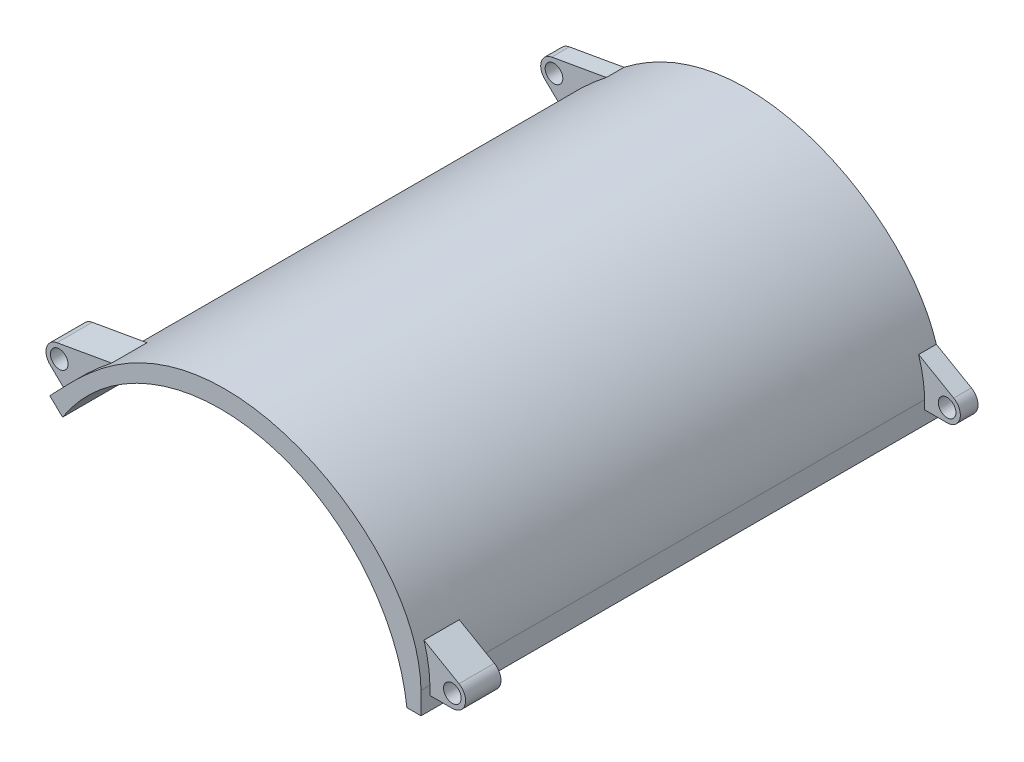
from build123d import *

# Parameters (mm, degrees)
BOSS_EXTRUDE1_DEPTH  = 295
BOSS_EXTRUDE13_START = -295
SKETCH3_R            = 10
BOSS_EXTRUDE13_DEPTH = 20
BOSS_EXTRUDE14_START = 245
SKETCH3_8_R          = 10
BOSS_EXTRUDE14_DEPTH = 40


with BuildPart() as part:
    # Sketch1 → Boss-Extrude1 (new, symmetric)
    with BuildSketch(Plane.XY):
        with BuildLine():
            Line((479.524287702, 25), (479.524287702, 50))
            add(Edge.make_bspline(
                [(69.720027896, 139.572690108), (108.18754722, 179.583185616), (152.416815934, 225.586540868), (219.133886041, 251.435560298), (287.408844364, 253.328836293), (359.356081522, 236.563554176), (477.15378099, 170.567422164), (479.524287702, 50)],
                knots=[0, 0, 0, 0, 0, 0, 0, 0, 1, 1, 1, 1, 1, 1, 1, 1], degree=7))
            Line((69.720027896, 139.572690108), (59.323974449, 128.759639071))
            Line((59.323974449, 128.759639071), (73.741375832, 114.898234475))
            ThreePointArc((73.741375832, 114.898234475), (300.256584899, 207.064141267), (463.524287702, 25))
            Line((463.524287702, 25), (479.524287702, 25))
        make_face()
    extrude(amount=BOSS_EXTRUDE1_DEPTH, both=True)

    # Sketch3 → Boss-Extrude13 (add)
    # profile 1 of 2: a face of its own
    with BuildSketch(Plane.XY.offset(BOSS_EXTRUDE13_START)):
        with BuildLine():
            Line((57.395277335, 174.772116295), (119.307330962, 185.688881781))
            add(Edge.make_bspline(
                [(69.720027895, 139.572690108), (76.074149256, 146.181682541), (82.585479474, 152.954189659), (89.329402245, 159.772367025), (96.35326765, 166.535005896), (103.683856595, 173.155904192), (111.333957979, 179.561593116), (119.307330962, 185.688881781)],
                knots=[0, 0, 0, 0, 0, 0, 0, 0, 0.165181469, 0.165181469, 0.165181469, 0.165181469, 0.165181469, 0.165181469, 0.165181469, 0.165181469], degree=7))
            Line((69.720027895, 139.572690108), (64.860756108, 134.518507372))
            Line((64.860756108, 134.518507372), (49.603946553, 149.186948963))
            ThreePointArc((49.603946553, 149.186948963), (45.650601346, 164.369754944), (57.395277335, 174.772116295))
        make_face()
        with Locations(Location((60, 160, 0), (0, 0, 180))):
            Circle(SKETCH3_R, mode=Mode.SUBTRACT)
    # profile 2 of 2: a face of its own
    with BuildSketch(Plane.XY.offset(BOSS_EXTRUDE13_START)):
        with BuildLine():
            Line((479.524287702, 50.000000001), (479.524287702, 40))
            Line((479.524287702, 40), (505, 40))
            ThreePointArc((505, 40), (519.488887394, 51.117714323), (512.5, 67.990381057))
            Line((512.5, 67.990381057), (472.826933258, 90.89563682))
            add(Edge.make_bspline(
                [(472.826933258, 90.89563682), (474.51705784, 85.487785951), (475.993797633, 79.937195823), (477.239796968, 74.242499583), (478.236465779, 68.402452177), (478.963896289, 62.415949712), (479.400774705, 56.282050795), (479.524287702, 50.000000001)],
                knots=[0.947895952, 0.947895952, 0.947895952, 0.947895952, 0.947895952, 0.947895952, 0.947895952, 0.947895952, 1, 1, 1, 1, 1, 1, 1, 1], degree=7))
        make_face()
        with Locations(Location((505, 55, 0), (0, 0, 180))):
            Circle(SKETCH3_R, mode=Mode.SUBTRACT)
    extrude(amount=BOSS_EXTRUDE13_DEPTH)

    # Sketch3_8 → Boss-Extrude14 (add)
    # profile 1 of 2: a face of its own
    with BuildSketch(Plane.XY.offset(BOSS_EXTRUDE14_START)):
        with BuildLine():
            Line((57.395277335, 174.772116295), (119.307330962, 185.688881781))
            add(Edge.make_bspline(
                [(69.720027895, 139.572690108), (76.074149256, 146.181682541), (82.585479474, 152.954189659), (89.329402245, 159.772367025), (96.35326765, 166.535005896), (103.683856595, 173.155904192), (111.333957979, 179.561593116), (119.307330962, 185.688881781)],
                knots=[0, 0, 0, 0, 0, 0, 0, 0, 0.165181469, 0.165181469, 0.165181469, 0.165181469, 0.165181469, 0.165181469, 0.165181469, 0.165181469], degree=7))
            Line((69.720027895, 139.572690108), (64.860756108, 134.518507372))
            Line((64.860756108, 134.518507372), (49.603946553, 149.186948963))
            ThreePointArc((49.603946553, 149.186948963), (45.650601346, 164.369754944), (57.395277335, 174.772116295))
        make_face()
        with Locations(Location((60, 160, 0), (0, 0, 180))):
            Circle(SKETCH3_8_R, mode=Mode.SUBTRACT)
    # profile 2 of 2: a face of its own
    with BuildSketch(Plane.XY.offset(BOSS_EXTRUDE14_START)):
        with BuildLine():
            Line((479.524287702, 50.000000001), (479.524287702, 40))
            Line((479.524287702, 40), (505, 40))
            ThreePointArc((505, 40), (519.488887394, 51.117714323), (512.5, 67.990381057))
            Line((512.5, 67.990381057), (472.826933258, 90.89563682))
            add(Edge.make_bspline(
                [(472.826933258, 90.89563682), (474.51705784, 85.487785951), (475.993797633, 79.937195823), (477.239796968, 74.242499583), (478.236465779, 68.402452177), (478.963896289, 62.415949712), (479.400774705, 56.282050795), (479.524287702, 50.000000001)],
                knots=[0.947895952, 0.947895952, 0.947895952, 0.947895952, 0.947895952, 0.947895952, 0.947895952, 0.947895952, 1, 1, 1, 1, 1, 1, 1, 1], degree=7))
        make_face()
        with Locations(Location((505, 55, 0), (0, 0, 180))):
            Circle(SKETCH3_8_R, mode=Mode.SUBTRACT)
    extrude(amount=BOSS_EXTRUDE14_DEPTH)


solid = part.part
